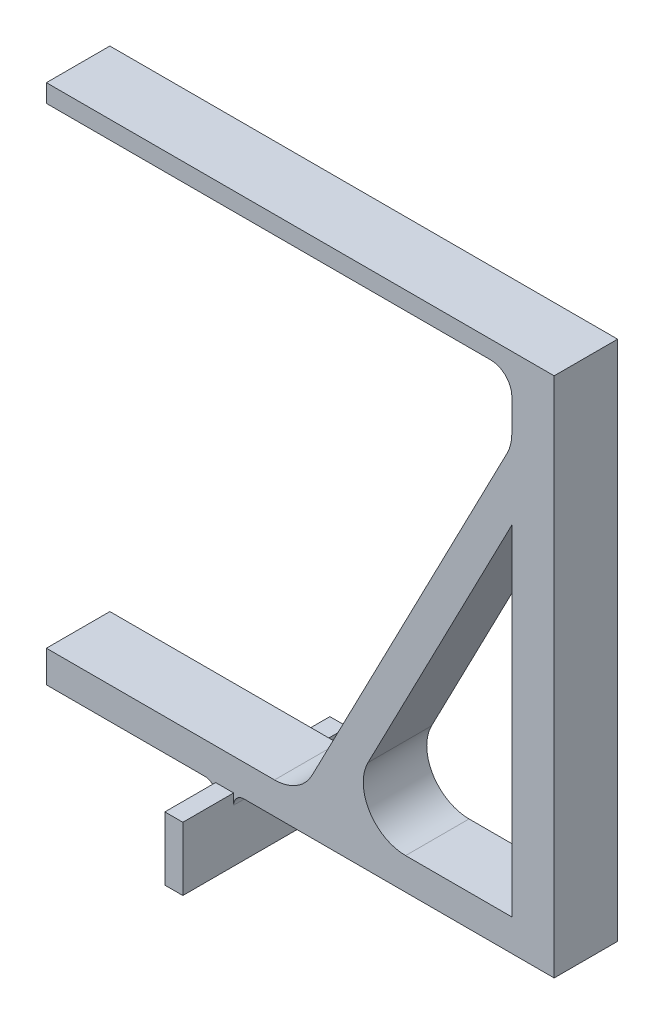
from build123d import *

# Parameters (mm, degrees)
BOSS_EXTRUDE1_DEPTH      = 3
FILLET1_R                = 2
FILLET2_R                = 1
BOSS_EXTRUDE2_DEPTH      = 2.4
BOSS_EXTRUDE2_DEPTH_BACK = 5.4
SKETCH2_W                = 0.85
SKETCH2_H                = 3
FILLET3_R                = 0.5
SKETCH3_W                = 3
SKETCH3_H                = 1.5
BOSS_EXTRUDE3_DEPTH      = 4


with BuildPart() as part:
    # Sketch1 → Boss-Extrude1 (new body)
    with BuildSketch(Plane.XY):
        Polygon((0, 3), (0, 0), (0.85, 0), (0.85, 3), (16, 3), (16, 27.65), (14, 27.65), (-8, 27.65), (-8, 26.8), (14, 26.8), (14, 23.8), (4, 4.5), (-4, 4.5), (-4, 3), align=None)
        Polygon((14, 4.5), (14, 20.539474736), (5.689391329, 4.5), align=None, mode=Mode.SUBTRACT)
    extrude(amount=BOSS_EXTRUDE1_DEPTH)

    # Fillet1
    fillet1_edges = [part.edges().sort_by_distance(p)[0] for p in [
        (4, 4.5, 1.5),
        (14, 23.8, 1.5),
        (5.689391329, 4.5, 1.5),
    ]]
    fillet(fillet1_edges, radius=FILLET1_R)

    # Fillet2
    fillet2_edges = [part.edges().sort_by_distance(p)[0] for p in [
        (14, 26.8, 1.5),
    ]]
    fillet(fillet2_edges, radius=FILLET2_R)

    # Sketch2 → Boss-Extrude2 (add, two sides: drawn at the far end of the back side and taken through both)
    with BuildSketch(Plane.XY.offset(3).offset(-BOSS_EXTRUDE2_DEPTH_BACK)):
        with Locations((0.425, 1.5)):
            Rectangle(SKETCH2_W, SKETCH2_H)
    extrude(amount=BOSS_EXTRUDE2_DEPTH + BOSS_EXTRUDE2_DEPTH_BACK)

    # Fillet3
    fillet3_edges = [part.edges().sort_by_distance(p)[0] for p in [
        (0, 3, 1.5),
        (0.85, 3, 1.5),
    ]]
    fillet(fillet3_edges, radius=FILLET3_R)

    # Sketch3 → Boss-Extrude3 (add)
    with BuildSketch(Plane.ZY.offset(4)):
        with Locations((1.5, 3.75)):
            Rectangle(SKETCH3_W, SKETCH3_H)
    extrude(amount=BOSS_EXTRUDE3_DEPTH)


solid = part.part
